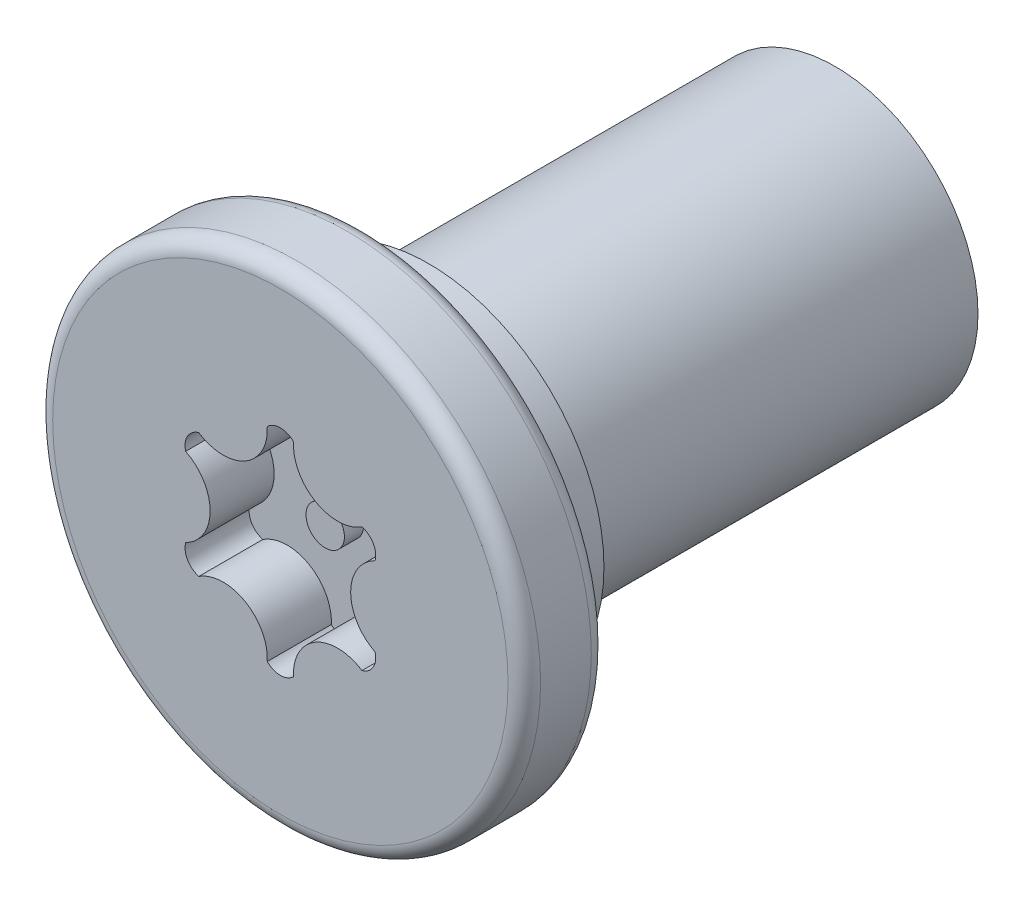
ISO-10303-21;
HEADER;
FILE_DESCRIPTION(('STEP AP214'),'2;1');
FILE_NAME('part.step','',(''),(''),'','','');
FILE_SCHEMA(('AUTOMOTIVE_DESIGN { 1 0 10303 214 1 1 1 1 }'));
ENDSEC;
DATA;
#1=APPLICATION_CONTEXT('core data for automotive mechanical design processes');
#2=APPLICATION_PROTOCOL_DEFINITION('international standard','automotive_design',2000,#1);
#3=PRODUCT_CONTEXT('',#1,'mechanical');
#4=PRODUCT('Part','Part','',(#3));
#5=PRODUCT_RELATED_PRODUCT_CATEGORY('part','',(#4));
#6=PRODUCT_DEFINITION_FORMATION('','',#4);
#7=PRODUCT_DEFINITION_CONTEXT('part definition',#1,'design');
#8=PRODUCT_DEFINITION('design','',#6,#7);
#9=PRODUCT_DEFINITION_SHAPE('','',#8);
#10=(LENGTH_UNIT() NAMED_UNIT(*) SI_UNIT(.MILLI.,.METRE.));
#11=(NAMED_UNIT(*) PLANE_ANGLE_UNIT() SI_UNIT($,.RADIAN.));
#12=(NAMED_UNIT(*) SI_UNIT($,.STERADIAN.) SOLID_ANGLE_UNIT());
#13=UNCERTAINTY_MEASURE_WITH_UNIT(LENGTH_MEASURE(1.E-05),#10,'distance_accuracy_value','');
#14=(GEOMETRIC_REPRESENTATION_CONTEXT(3) GLOBAL_UNCERTAINTY_ASSIGNED_CONTEXT((#13)) GLOBAL_UNIT_ASSIGNED_CONTEXT((#10,
#11,#12)) REPRESENTATION_CONTEXT('',''));
#15=CARTESIAN_POINT('',(0.,0.,0.));
#16=DIRECTION('',(0.,0.,1.));
#17=DIRECTION('',(1.,0.,0.));
#18=AXIS2_PLACEMENT_3D('',#15,#16,#17);
#19=CARTESIAN_POINT('',(0.,0.,0.));
#20=DIRECTION('',(0.,0.,1.));
#21=DIRECTION('',(1.,0.,0.));
#22=AXIS2_PLACEMENT_3D('',#19,#20,#21);
#23=PLANE('',#22);
#24=CARTESIAN_POINT('',(0.,0.,0.));
#25=DIRECTION('',(0.,0.,1.));
#26=DIRECTION('',(1.,0.,0.));
#27=AXIS2_PLACEMENT_3D('',#24,#25,#26);
#28=CIRCLE('',#27,3.55599999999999);
#29=CARTESIAN_POINT('',(3.55599999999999,0.,0.));
#30=VERTEX_POINT('',#29);
#31=EDGE_CURVE('E54',#30,#30,#28,.T.);
#32=ORIENTED_EDGE('',*,*,#31,.T.);
#33=EDGE_LOOP('',(#32));
#34=FACE_BOUND('',#33,.T.);
#35=CARTESIAN_POINT('',(0.893828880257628,1.54815703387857,0.));
#36=DIRECTION('',(0.,0.,1.));
#37=DIRECTION('',(1.,0.,0.));
#38=AXIS2_PLACEMENT_3D('',#35,#36,#37);
#39=CIRCLE('',#38,0.69);
#40=CARTESIAN_POINT('',(0.205060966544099,1.58937306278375,0.));
#41=VERTEX_POINT('',#40);
#42=CARTESIAN_POINT('',(1.27390696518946,0.972274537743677,0.));
#43=VERTEX_POINT('',#42);
#44=EDGE_CURVE('E181',#41,#43,#39,.T.);
#45=ORIENTED_EDGE('',*,*,#44,.T.);
#46=CARTESIAN_POINT('',(1.19884944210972,0.692156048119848,0.));
#47=DIRECTION('',(0.,0.,1.));
#48=DIRECTION('',(1.,0.,0.));
#49=AXIS2_PLACEMENT_3D('',#46,#47,#48);
#50=CIRCLE('',#49,0.29);
#51=CARTESIAN_POINT('',(1.47896793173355,0.617098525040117,0.));
#52=VERTEX_POINT('',#51);
#53=EDGE_CURVE('E61',#43,#52,#50,.F.);
#54=ORIENTED_EDGE('',*,*,#53,.T.);
#55=CARTESIAN_POINT('',(1.78765776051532,0.,0.));
#56=DIRECTION('',(0.,0.,1.));
#57=DIRECTION('',(1.,0.,0.));
#58=AXIS2_PLACEMENT_3D('',#55,#56,#57);
#59=CIRCLE('',#58,0.69);
#60=CARTESIAN_POINT('',(1.47896793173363,-0.617098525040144,0.));
#61=VERTEX_POINT('',#60);
#62=EDGE_CURVE('E111',#52,#61,#59,.T.);
#63=ORIENTED_EDGE('',*,*,#62,.T.);
#64=CARTESIAN_POINT('',(1.1988494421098,-0.692156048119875,0.));
#65=DIRECTION('',(0.,0.,1.));
#66=DIRECTION('',(1.,0.,0.));
#67=AXIS2_PLACEMENT_3D('',#64,#65,#66);
#68=CIRCLE('',#67,0.29);
#69=CARTESIAN_POINT('',(1.27390696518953,-0.972274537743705,0.));
#70=VERTEX_POINT('',#69);
#71=EDGE_CURVE('E216',#61,#70,#68,.F.);
#72=ORIENTED_EDGE('',*,*,#71,.T.);
#73=CARTESIAN_POINT('',(0.893828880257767,-1.54815703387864,0.));
#74=DIRECTION('',(0.,0.,1.));
#75=DIRECTION('',(1.,0.,0.));
#76=AXIS2_PLACEMENT_3D('',#73,#74,#75);
#77=CIRCLE('',#76,0.69);
#78=CARTESIAN_POINT('',(0.205060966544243,-1.5893730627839,0.));
#79=VERTEX_POINT('',#78);
#80=EDGE_CURVE('E160',#70,#79,#77,.T.);
#81=ORIENTED_EDGE('',*,*,#80,.T.);
#82=CARTESIAN_POINT('',(1.43067375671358E-13,-1.3843120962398,0.));
#83=DIRECTION('',(0.,0.,1.));
#84=DIRECTION('',(1.,0.,0.));
#85=AXIS2_PLACEMENT_3D('',#82,#83,#84);
#86=CIRCLE('',#85,0.29);
#87=CARTESIAN_POINT('',(-0.205060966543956,-1.5893730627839,0.));
#88=VERTEX_POINT('',#87);
#89=EDGE_CURVE('E210',#79,#88,#86,.F.);
#90=ORIENTED_EDGE('',*,*,#89,.T.);
#91=CARTESIAN_POINT('',(-0.893828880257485,-1.54815703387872,0.));
#92=DIRECTION('',(0.,0.,1.));
#93=DIRECTION('',(1.,0.,0.));
#94=AXIS2_PLACEMENT_3D('',#91,#92,#93);
#95=CIRCLE('',#94,0.69);
#96=CARTESIAN_POINT('',(-1.27390696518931,-0.97227453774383,0.));
#97=VERTEX_POINT('',#96);
#98=EDGE_CURVE('E206',#88,#97,#95,.T.);
#99=ORIENTED_EDGE('',*,*,#98,.T.);
#100=CARTESIAN_POINT('',(-1.19884944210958,-0.69215604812,0.));
#101=DIRECTION('',(0.,0.,1.));
#102=DIRECTION('',(1.,0.,0.));
#103=AXIS2_PLACEMENT_3D('',#100,#101,#102);
#104=CIRCLE('',#103,0.29);
#105=CARTESIAN_POINT('',(-1.47896793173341,-0.617098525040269,0.));
#106=VERTEX_POINT('',#105);
#107=EDGE_CURVE('E202',#97,#106,#104,.F.);
#108=ORIENTED_EDGE('',*,*,#107,.T.);
#109=CARTESIAN_POINT('',(-1.78765776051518,-1.56674837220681E-13,0.));
#110=DIRECTION('',(0.,0.,1.));
#111=DIRECTION('',(1.,0.,0.));
#112=AXIS2_PLACEMENT_3D('',#109,#110,#111);
#113=CIRCLE('',#112,0.69);
#114=CARTESIAN_POINT('',(-1.47896793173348,0.617098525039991,0.));
#115=VERTEX_POINT('',#114);
#116=EDGE_CURVE('E198',#106,#115,#113,.T.);
#117=ORIENTED_EDGE('',*,*,#116,.T.);
#118=CARTESIAN_POINT('',(-1.19884944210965,0.692156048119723,0.));
#119=DIRECTION('',(0.,0.,1.));
#120=DIRECTION('',(1.,0.,0.));
#121=AXIS2_PLACEMENT_3D('',#118,#119,#120);
#122=CIRCLE('',#121,0.29);
#123=CARTESIAN_POINT('',(-1.27390696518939,0.972274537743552,0.));
#124=VERTEX_POINT('',#123);
#125=EDGE_CURVE('E194',#115,#124,#122,.F.);
#126=ORIENTED_EDGE('',*,*,#125,.T.);
#127=CARTESIAN_POINT('',(-0.893828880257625,1.54815703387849,0.));
#128=DIRECTION('',(0.,0.,1.));
#129=DIRECTION('',(1.,0.,0.));
#130=AXIS2_PLACEMENT_3D('',#127,#128,#129);
#131=CIRCLE('',#130,0.690000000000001);
#132=CARTESIAN_POINT('',(-0.205060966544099,1.58937306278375,0.));
#133=VERTEX_POINT('',#132);
#134=EDGE_CURVE('E190',#124,#133,#131,.T.);
#135=ORIENTED_EDGE('',*,*,#134,.T.);
#136=CARTESIAN_POINT('',(0.,1.38431209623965,0.));
#137=DIRECTION('',(0.,0.,1.));
#138=DIRECTION('',(1.,0.,0.));
#139=AXIS2_PLACEMENT_3D('',#136,#137,#138);
#140=CIRCLE('',#139,0.29);
#141=EDGE_CURVE('E186',#133,#41,#140,.F.);
#142=ORIENTED_EDGE('',*,*,#141,.T.);
#143=EDGE_LOOP('',(#45,#54,#63,#72,#81,#90,#99,#108,#117,#126,#135,#142));
#144=FACE_BOUND('',#143,.T.);
#145=ADVANCED_FACE('F45',(#34,#144),#23,.T.);
#146=CARTESIAN_POINT('',(0.,0.,-1.3));
#147=DIRECTION('',(0.,0.,1.));
#148=DIRECTION('',(1.,0.,0.));
#149=AXIS2_PLACEMENT_3D('',#146,#147,#148);
#150=PLANE('',#149);
#151=CARTESIAN_POINT('',(0.,0.,-1.3));
#152=DIRECTION('',(0.,0.,1.));
#153=DIRECTION('',(1.,0.,0.));
#154=AXIS2_PLACEMENT_3D('',#151,#152,#153);
#155=CIRCLE('',#154,2.738000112);
#156=CARTESIAN_POINT('',(2.738000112,0.,-1.3));
#157=VERTEX_POINT('',#156);
#158=EDGE_CURVE('E11',#157,#157,#155,.F.);
#159=ORIENTED_EDGE('',*,*,#158,.F.);
#160=EDGE_LOOP('',(#159));
#161=FACE_BOUND('',#160,.T.);
#162=CARTESIAN_POINT('',(0.,0.,-1.3));
#163=DIRECTION('',(0.,0.,1.));
#164=DIRECTION('',(1.,0.,0.));
#165=AXIS2_PLACEMENT_3D('',#162,#163,#164);
#166=CIRCLE('',#165,3.55599999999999);
#167=CARTESIAN_POINT('',(3.55599999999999,0.,-1.3));
#168=VERTEX_POINT('',#167);
#169=EDGE_CURVE('E260',#168,#168,#166,.F.);
#170=ORIENTED_EDGE('',*,*,#169,.T.);
#171=EDGE_LOOP('',(#170));
#172=FACE_BOUND('',#171,.T.);
#173=ADVANCED_FACE('F283',(#161,#172),#150,.F.);
#174=CARTESIAN_POINT('',(0.,0.,-1.3));
#175=DIRECTION('',(0.,0.,1.));
#176=DIRECTION('',(1.,0.,0.));
#177=AXIS2_PLACEMENT_3D('',#174,#175,#176);
#178=CYLINDRICAL_SURFACE('',#177,3.80999999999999);
#179=CARTESIAN_POINT('',(0.,0.,-1.046));
#180=DIRECTION('',(0.,0.,1.));
#181=DIRECTION('',(1.,0.,0.));
#182=AXIS2_PLACEMENT_3D('',#179,#180,#181);
#183=CIRCLE('',#182,3.80999999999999);
#184=CARTESIAN_POINT('',(3.80999999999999,0.,-1.046));
#185=VERTEX_POINT('',#184);
#186=EDGE_CURVE('E256',#185,#185,#183,.T.);
#187=ORIENTED_EDGE('',*,*,#186,.T.);
#188=EDGE_LOOP('',(#187));
#189=FACE_BOUND('',#188,.T.);
#190=CARTESIAN_POINT('',(0.,0.,-0.254));
#191=DIRECTION('',(0.,0.,1.));
#192=DIRECTION('',(1.,0.,0.));
#193=AXIS2_PLACEMENT_3D('',#190,#191,#192);
#194=CIRCLE('',#193,3.80999999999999);
#195=CARTESIAN_POINT('',(3.80999999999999,0.,-0.254));
#196=VERTEX_POINT('',#195);
#197=EDGE_CURVE('E225',#196,#196,#194,.F.);
#198=ORIENTED_EDGE('',*,*,#197,.T.);
#199=EDGE_LOOP('',(#198));
#200=FACE_BOUND('',#199,.T.);
#201=ADVANCED_FACE('F289',(#189,#200),#178,.T.);
#202=CARTESIAN_POINT('',(1.19884944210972,0.692156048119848,-1.));
#203=DIRECTION('',(0.,0.,1.));
#204=DIRECTION('',(1.,0.,0.));
#205=AXIS2_PLACEMENT_3D('',#202,#203,#204);
#206=CYLINDRICAL_SURFACE('',#205,0.29);
#207=ORIENTED_EDGE('',*,*,#53,.F.);
#208=DIRECTION('',(0.,0.,1.));
#209=VECTOR('',#208,1.);
#210=CARTESIAN_POINT('',(1.27390696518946,0.972274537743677,-1.));
#211=LINE('',#210,#209);
#212=CARTESIAN_POINT('',(1.27390696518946,0.972274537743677,-1.));
#213=VERTEX_POINT('',#212);
#214=EDGE_CURVE('E178',#213,#43,#211,.T.);
#215=ORIENTED_EDGE('',*,*,#214,.F.);
#216=CARTESIAN_POINT('',(1.19884944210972,0.692156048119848,-1.));
#217=DIRECTION('',(0.,0.,1.));
#218=DIRECTION('',(1.,0.,0.));
#219=AXIS2_PLACEMENT_3D('',#216,#217,#218);
#220=CIRCLE('',#219,0.29);
#221=CARTESIAN_POINT('',(1.47896793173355,0.617098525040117,-1.));
#222=VERTEX_POINT('',#221);
#223=EDGE_CURVE('E221',#213,#222,#220,.F.);
#224=ORIENTED_EDGE('',*,*,#223,.T.);
#225=DIRECTION('',(0.,0.,1.));
#226=VECTOR('',#225,1.);
#227=CARTESIAN_POINT('',(1.47896793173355,0.617098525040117,-1.));
#228=LINE('',#227,#226);
#229=EDGE_CURVE('E222',#222,#52,#228,.T.);
#230=ORIENTED_EDGE('',*,*,#229,.T.);
#231=EDGE_LOOP('',(#207,#215,#224,#230));
#232=FACE_BOUND('',#231,.T.);
#233=ADVANCED_FACE('F294',(#232),#206,.F.);
#234=CARTESIAN_POINT('',(1.78765776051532,0.,-1.));
#235=DIRECTION('',(0.,0.,1.));
#236=DIRECTION('',(1.,0.,0.));
#237=AXIS2_PLACEMENT_3D('',#234,#235,#236);
#238=CYLINDRICAL_SURFACE('',#237,0.69);
#239=ORIENTED_EDGE('',*,*,#62,.F.);
#240=ORIENTED_EDGE('',*,*,#229,.F.);
#241=CARTESIAN_POINT('',(1.78765776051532,0.,-1.));
#242=DIRECTION('',(0.,0.,1.));
#243=DIRECTION('',(1.,0.,0.));
#244=AXIS2_PLACEMENT_3D('',#241,#242,#243);
#245=CIRCLE('',#244,0.69);
#246=CARTESIAN_POINT('',(1.47896793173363,-0.617098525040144,-1.));
#247=VERTEX_POINT('',#246);
#248=EDGE_CURVE('E70',#222,#247,#245,.T.);
#249=ORIENTED_EDGE('',*,*,#248,.T.);
#250=DIRECTION('',(0.,0.,1.));
#251=VECTOR('',#250,1.);
#252=CARTESIAN_POINT('',(1.47896793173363,-0.617098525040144,-1.));
#253=LINE('',#252,#251);
#254=EDGE_CURVE('E151',#247,#61,#253,.T.);
#255=ORIENTED_EDGE('',*,*,#254,.T.);
#256=EDGE_LOOP('',(#239,#240,#249,#255));
#257=FACE_BOUND('',#256,.T.);
#258=ADVANCED_FACE('F301',(#257),#238,.T.);
#259=CARTESIAN_POINT('',(1.1988494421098,-0.692156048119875,-1.));
#260=DIRECTION('',(0.,0.,1.));
#261=DIRECTION('',(1.,0.,0.));
#262=AXIS2_PLACEMENT_3D('',#259,#260,#261);
#263=CYLINDRICAL_SURFACE('',#262,0.29);
#264=ORIENTED_EDGE('',*,*,#71,.F.);
#265=ORIENTED_EDGE('',*,*,#254,.F.);
#266=CARTESIAN_POINT('',(1.1988494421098,-0.692156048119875,-1.));
#267=DIRECTION('',(0.,0.,1.));
#268=DIRECTION('',(1.,0.,0.));
#269=AXIS2_PLACEMENT_3D('',#266,#267,#268);
#270=CIRCLE('',#269,0.29);
#271=CARTESIAN_POINT('',(1.27390696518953,-0.972274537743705,-1.));
#272=VERTEX_POINT('',#271);
#273=EDGE_CURVE('E145',#247,#272,#270,.F.);
#274=ORIENTED_EDGE('',*,*,#273,.T.);
#275=DIRECTION('',(0.,0.,1.));
#276=VECTOR('',#275,1.);
#277=CARTESIAN_POINT('',(1.27390696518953,-0.972274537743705,-1.));
#278=LINE('',#277,#276);
#279=EDGE_CURVE('E149',#272,#70,#278,.T.);
#280=ORIENTED_EDGE('',*,*,#279,.T.);
#281=EDGE_LOOP('',(#264,#265,#274,#280));
#282=FACE_BOUND('',#281,.T.);
#283=ADVANCED_FACE('F148',(#282),#263,.F.);
#284=CARTESIAN_POINT('',(0.893828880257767,-1.54815703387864,-1.));
#285=DIRECTION('',(0.,0.,1.));
#286=DIRECTION('',(1.,0.,0.));
#287=AXIS2_PLACEMENT_3D('',#284,#285,#286);
#288=CYLINDRICAL_SURFACE('',#287,0.69);
#289=ORIENTED_EDGE('',*,*,#80,.F.);
#290=ORIENTED_EDGE('',*,*,#279,.F.);
#291=CARTESIAN_POINT('',(0.893828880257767,-1.54815703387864,-1.));
#292=DIRECTION('',(0.,0.,1.));
#293=DIRECTION('',(1.,0.,0.));
#294=AXIS2_PLACEMENT_3D('',#291,#292,#293);
#295=CIRCLE('',#294,0.69);
#296=CARTESIAN_POINT('',(0.205060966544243,-1.5893730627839,-1.));
#297=VERTEX_POINT('',#296);
#298=EDGE_CURVE('E154',#272,#297,#295,.T.);
#299=ORIENTED_EDGE('',*,*,#298,.T.);
#300=DIRECTION('',(0.,0.,1.));
#301=VECTOR('',#300,1.);
#302=CARTESIAN_POINT('',(0.205060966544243,-1.5893730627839,-1.));
#303=LINE('',#302,#301);
#304=EDGE_CURVE('E163',#297,#79,#303,.T.);
#305=ORIENTED_EDGE('',*,*,#304,.T.);
#306=EDGE_LOOP('',(#289,#290,#299,#305));
#307=FACE_BOUND('',#306,.T.);
#308=ADVANCED_FACE('F157',(#307),#288,.T.);
#309=CARTESIAN_POINT('',(1.43067375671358E-13,-1.3843120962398,-1.));
#310=DIRECTION('',(0.,0.,1.));
#311=DIRECTION('',(1.,0.,0.));
#312=AXIS2_PLACEMENT_3D('',#309,#310,#311);
#313=CYLINDRICAL_SURFACE('',#312,0.29);
#314=ORIENTED_EDGE('',*,*,#89,.F.);
#315=ORIENTED_EDGE('',*,*,#304,.F.);
#316=CARTESIAN_POINT('',(1.43067375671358E-13,-1.3843120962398,-1.));
#317=DIRECTION('',(0.,0.,1.));
#318=DIRECTION('',(1.,0.,0.));
#319=AXIS2_PLACEMENT_3D('',#316,#317,#318);
#320=CIRCLE('',#319,0.29);
#321=CARTESIAN_POINT('',(-0.205060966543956,-1.5893730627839,-1.));
#322=VERTEX_POINT('',#321);
#323=EDGE_CURVE('E168',#297,#322,#320,.F.);
#324=ORIENTED_EDGE('',*,*,#323,.T.);
#325=DIRECTION('',(0.,0.,1.));
#326=VECTOR('',#325,1.);
#327=CARTESIAN_POINT('',(-0.205060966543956,-1.5893730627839,-1.));
#328=LINE('',#327,#326);
#329=EDGE_CURVE('E230',#322,#88,#328,.T.);
#330=ORIENTED_EDGE('',*,*,#329,.T.);
#331=EDGE_LOOP('',(#314,#315,#324,#330));
#332=FACE_BOUND('',#331,.T.);
#333=ADVANCED_FACE('F318',(#332),#313,.F.);
#334=CARTESIAN_POINT('',(-0.893828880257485,-1.54815703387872,-1.));
#335=DIRECTION('',(0.,0.,1.));
#336=DIRECTION('',(1.,0.,0.));
#337=AXIS2_PLACEMENT_3D('',#334,#335,#336);
#338=CYLINDRICAL_SURFACE('',#337,0.69);
#339=ORIENTED_EDGE('',*,*,#98,.F.);
#340=ORIENTED_EDGE('',*,*,#329,.F.);
#341=CARTESIAN_POINT('',(-0.893828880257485,-1.54815703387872,-1.));
#342=DIRECTION('',(0.,0.,1.));
#343=DIRECTION('',(1.,0.,0.));
#344=AXIS2_PLACEMENT_3D('',#341,#342,#343);
#345=CIRCLE('',#344,0.69);
#346=CARTESIAN_POINT('',(-1.27390696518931,-0.97227453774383,-1.));
#347=VERTEX_POINT('',#346);
#348=EDGE_CURVE('E172',#322,#347,#345,.T.);
#349=ORIENTED_EDGE('',*,*,#348,.T.);
#350=DIRECTION('',(0.,0.,1.));
#351=VECTOR('',#350,1.);
#352=CARTESIAN_POINT('',(-1.27390696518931,-0.97227453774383,-1.));
#353=LINE('',#352,#351);
#354=EDGE_CURVE('E233',#347,#97,#353,.T.);
#355=ORIENTED_EDGE('',*,*,#354,.T.);
#356=EDGE_LOOP('',(#339,#340,#349,#355));
#357=FACE_BOUND('',#356,.T.);
#358=ADVANCED_FACE('F321',(#357),#338,.T.);
#359=CARTESIAN_POINT('',(-1.19884944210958,-0.69215604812,-1.));
#360=DIRECTION('',(0.,0.,1.));
#361=DIRECTION('',(1.,0.,0.));
#362=AXIS2_PLACEMENT_3D('',#359,#360,#361);
#363=CYLINDRICAL_SURFACE('',#362,0.29);
#364=ORIENTED_EDGE('',*,*,#107,.F.);
#365=ORIENTED_EDGE('',*,*,#354,.F.);
#366=CARTESIAN_POINT('',(-1.19884944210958,-0.69215604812,-1.));
#367=DIRECTION('',(0.,0.,1.));
#368=DIRECTION('',(1.,0.,0.));
#369=AXIS2_PLACEMENT_3D('',#366,#367,#368);
#370=CIRCLE('',#369,0.29);
#371=CARTESIAN_POINT('',(-1.47896793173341,-0.617098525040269,-1.));
#372=VERTEX_POINT('',#371);
#373=EDGE_CURVE('E374',#347,#372,#370,.F.);
#374=ORIENTED_EDGE('',*,*,#373,.T.);
#375=DIRECTION('',(0.,0.,1.));
#376=VECTOR('',#375,1.);
#377=CARTESIAN_POINT('',(-1.47896793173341,-0.617098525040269,-1.));
#378=LINE('',#377,#376);
#379=EDGE_CURVE('E236',#372,#106,#378,.T.);
#380=ORIENTED_EDGE('',*,*,#379,.T.);
#381=EDGE_LOOP('',(#364,#365,#374,#380));
#382=FACE_BOUND('',#381,.T.);
#383=ADVANCED_FACE('F325',(#382),#363,.F.);
#384=CARTESIAN_POINT('',(-1.78765776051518,-1.56674837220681E-13,-1.));
#385=DIRECTION('',(0.,0.,1.));
#386=DIRECTION('',(1.,0.,0.));
#387=AXIS2_PLACEMENT_3D('',#384,#385,#386);
#388=CYLINDRICAL_SURFACE('',#387,0.69);
#389=ORIENTED_EDGE('',*,*,#116,.F.);
#390=ORIENTED_EDGE('',*,*,#379,.F.);
#391=CARTESIAN_POINT('',(-1.78765776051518,-1.56674837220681E-13,-1.));
#392=DIRECTION('',(0.,0.,1.));
#393=DIRECTION('',(1.,0.,0.));
#394=AXIS2_PLACEMENT_3D('',#391,#392,#393);
#395=CIRCLE('',#394,0.69);
#396=CARTESIAN_POINT('',(-1.47896793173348,0.617098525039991,-1.));
#397=VERTEX_POINT('',#396);
#398=EDGE_CURVE('E371',#372,#397,#395,.T.);
#399=ORIENTED_EDGE('',*,*,#398,.T.);
#400=DIRECTION('',(0.,0.,1.));
#401=VECTOR('',#400,1.);
#402=CARTESIAN_POINT('',(-1.47896793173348,0.617098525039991,-1.));
#403=LINE('',#402,#401);
#404=EDGE_CURVE('E239',#397,#115,#403,.T.);
#405=ORIENTED_EDGE('',*,*,#404,.T.);
#406=EDGE_LOOP('',(#389,#390,#399,#405));
#407=FACE_BOUND('',#406,.T.);
#408=ADVANCED_FACE('F329',(#407),#388,.T.);
#409=CARTESIAN_POINT('',(-1.19884944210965,0.692156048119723,-1.));
#410=DIRECTION('',(0.,0.,1.));
#411=DIRECTION('',(1.,0.,0.));
#412=AXIS2_PLACEMENT_3D('',#409,#410,#411);
#413=CYLINDRICAL_SURFACE('',#412,0.29);
#414=ORIENTED_EDGE('',*,*,#125,.F.);
#415=ORIENTED_EDGE('',*,*,#404,.F.);
#416=CARTESIAN_POINT('',(-1.19884944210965,0.692156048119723,-1.));
#417=DIRECTION('',(0.,0.,1.));
#418=DIRECTION('',(1.,0.,0.));
#419=AXIS2_PLACEMENT_3D('',#416,#417,#418);
#420=CIRCLE('',#419,0.29);
#421=CARTESIAN_POINT('',(-1.27390696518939,0.972274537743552,-1.));
#422=VERTEX_POINT('',#421);
#423=EDGE_CURVE('E364',#397,#422,#420,.F.);
#424=ORIENTED_EDGE('',*,*,#423,.T.);
#425=DIRECTION('',(0.,0.,1.));
#426=VECTOR('',#425,1.);
#427=CARTESIAN_POINT('',(-1.27390696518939,0.972274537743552,-1.));
#428=LINE('',#427,#426);
#429=EDGE_CURVE('E242',#422,#124,#428,.T.);
#430=ORIENTED_EDGE('',*,*,#429,.T.);
#431=EDGE_LOOP('',(#414,#415,#424,#430));
#432=FACE_BOUND('',#431,.T.);
#433=ADVANCED_FACE('F333',(#432),#413,.F.);
#434=CARTESIAN_POINT('',(-0.893828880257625,1.54815703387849,-1.));
#435=DIRECTION('',(0.,0.,1.));
#436=DIRECTION('',(1.,0.,0.));
#437=AXIS2_PLACEMENT_3D('',#434,#435,#436);
#438=CYLINDRICAL_SURFACE('',#437,0.690000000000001);
#439=ORIENTED_EDGE('',*,*,#134,.F.);
#440=ORIENTED_EDGE('',*,*,#429,.F.);
#441=CARTESIAN_POINT('',(-0.893828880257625,1.54815703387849,-1.));
#442=DIRECTION('',(0.,0.,1.));
#443=DIRECTION('',(1.,0.,0.));
#444=AXIS2_PLACEMENT_3D('',#441,#442,#443);
#445=CIRCLE('',#444,0.690000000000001);
#446=CARTESIAN_POINT('',(-0.205060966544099,1.58937306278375,-1.));
#447=VERTEX_POINT('',#446);
#448=EDGE_CURVE('E360',#422,#447,#445,.T.);
#449=ORIENTED_EDGE('',*,*,#448,.T.);
#450=DIRECTION('',(0.,0.,1.));
#451=VECTOR('',#450,1.);
#452=CARTESIAN_POINT('',(-0.205060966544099,1.58937306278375,-1.));
#453=LINE('',#452,#451);
#454=EDGE_CURVE('E245',#447,#133,#453,.T.);
#455=ORIENTED_EDGE('',*,*,#454,.T.);
#456=EDGE_LOOP('',(#439,#440,#449,#455));
#457=FACE_BOUND('',#456,.T.);
#458=ADVANCED_FACE('F337',(#457),#438,.T.);
#459=CARTESIAN_POINT('',(0.,1.38431209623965,-1.));
#460=DIRECTION('',(0.,0.,1.));
#461=DIRECTION('',(1.,0.,0.));
#462=AXIS2_PLACEMENT_3D('',#459,#460,#461);
#463=CYLINDRICAL_SURFACE('',#462,0.29);
#464=ORIENTED_EDGE('',*,*,#141,.F.);
#465=ORIENTED_EDGE('',*,*,#454,.F.);
#466=CARTESIAN_POINT('',(0.,1.38431209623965,-1.));
#467=DIRECTION('',(0.,0.,1.));
#468=DIRECTION('',(1.,0.,0.));
#469=AXIS2_PLACEMENT_3D('',#466,#467,#468);
#470=CIRCLE('',#469,0.29);
#471=CARTESIAN_POINT('',(0.205060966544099,1.58937306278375,-1.));
#472=VERTEX_POINT('',#471);
#473=EDGE_CURVE('E357',#447,#472,#470,.F.);
#474=ORIENTED_EDGE('',*,*,#473,.T.);
#475=DIRECTION('',(0.,0.,1.));
#476=VECTOR('',#475,1.);
#477=CARTESIAN_POINT('',(0.205060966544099,1.58937306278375,-1.));
#478=LINE('',#477,#476);
#479=EDGE_CURVE('E248',#472,#41,#478,.T.);
#480=ORIENTED_EDGE('',*,*,#479,.T.);
#481=EDGE_LOOP('',(#464,#465,#474,#480));
#482=FACE_BOUND('',#481,.T.);
#483=ADVANCED_FACE('F341',(#482),#463,.F.);
#484=CARTESIAN_POINT('',(0.893828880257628,1.54815703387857,-1.));
#485=DIRECTION('',(0.,0.,1.));
#486=DIRECTION('',(1.,0.,0.));
#487=AXIS2_PLACEMENT_3D('',#484,#485,#486);
#488=CYLINDRICAL_SURFACE('',#487,0.69);
#489=ORIENTED_EDGE('',*,*,#44,.F.);
#490=ORIENTED_EDGE('',*,*,#479,.F.);
#491=CARTESIAN_POINT('',(0.893828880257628,1.54815703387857,-1.));
#492=DIRECTION('',(0.,0.,1.));
#493=DIRECTION('',(1.,0.,0.));
#494=AXIS2_PLACEMENT_3D('',#491,#492,#493);
#495=CIRCLE('',#494,0.69);
#496=EDGE_CURVE('E118',#472,#213,#495,.T.);
#497=ORIENTED_EDGE('',*,*,#496,.T.);
#498=ORIENTED_EDGE('',*,*,#214,.T.);
#499=EDGE_LOOP('',(#489,#490,#497,#498));
#500=FACE_BOUND('',#499,.T.);
#501=ADVANCED_FACE('F344',(#500),#488,.T.);
#502=CARTESIAN_POINT('',(0.,0.,-1.));
#503=DIRECTION('',(0.,0.,1.));
#504=DIRECTION('',(1.,0.,0.));
#505=AXIS2_PLACEMENT_3D('',#502,#503,#504);
#506=PLANE('',#505);
#507=CARTESIAN_POINT('',(0.,0.,-1.));
#508=DIRECTION('',(0.,0.,1.));
#509=DIRECTION('',(1.,0.,0.));
#510=AXIS2_PLACEMENT_3D('',#507,#508,#509);
#511=CIRCLE('',#510,0.3);
#512=CARTESIAN_POINT('',(0.3,0.,-1.));
#513=VERTEX_POINT('',#512);
#514=EDGE_CURVE('E396',#513,#513,#511,.T.);
#515=ORIENTED_EDGE('',*,*,#514,.F.);
#516=EDGE_LOOP('',(#515));
#517=FACE_BOUND('',#516,.T.);
#518=ORIENTED_EDGE('',*,*,#223,.F.);
#519=ORIENTED_EDGE('',*,*,#496,.F.);
#520=ORIENTED_EDGE('',*,*,#473,.F.);
#521=ORIENTED_EDGE('',*,*,#448,.F.);
#522=ORIENTED_EDGE('',*,*,#423,.F.);
#523=ORIENTED_EDGE('',*,*,#398,.F.);
#524=ORIENTED_EDGE('',*,*,#373,.F.);
#525=ORIENTED_EDGE('',*,*,#348,.F.);
#526=ORIENTED_EDGE('',*,*,#323,.F.);
#527=ORIENTED_EDGE('',*,*,#298,.F.);
#528=ORIENTED_EDGE('',*,*,#273,.F.);
#529=ORIENTED_EDGE('',*,*,#248,.F.);
#530=EDGE_LOOP('',(#518,#519,#520,#521,#522,#523,#524,#525,#526,#527,#528,#529));
#531=FACE_BOUND('',#530,.T.);
#532=ADVANCED_FACE('F166',(#517,#531),#506,.T.);
#533=CARTESIAN_POINT('',(0.,0.,-1.046));
#534=DIRECTION('',(0.,0.,1.));
#535=DIRECTION('',(1.,0.,0.));
#536=AXIS2_PLACEMENT_3D('',#533,#534,#535);
#537=TOROIDAL_SURFACE('',#536,3.55599999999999,0.254);
#538=ORIENTED_EDGE('',*,*,#169,.F.);
#539=EDGE_LOOP('',(#538));
#540=FACE_BOUND('',#539,.T.);
#541=ORIENTED_EDGE('',*,*,#186,.F.);
#542=EDGE_LOOP('',(#541));
#543=FACE_BOUND('',#542,.T.);
#544=ADVANCED_FACE('F271',(#540,#543),#537,.T.);
#545=CARTESIAN_POINT('',(0.,0.,-0.254));
#546=DIRECTION('',(0.,0.,1.));
#547=DIRECTION('',(1.,0.,0.));
#548=AXIS2_PLACEMENT_3D('',#545,#546,#547);
#549=TOROIDAL_SURFACE('',#548,3.55599999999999,0.254);
#550=ORIENTED_EDGE('',*,*,#197,.F.);
#551=EDGE_LOOP('',(#550));
#552=FACE_BOUND('',#551,.T.);
#553=ORIENTED_EDGE('',*,*,#31,.F.);
#554=EDGE_LOOP('',(#553));
#555=FACE_BOUND('',#554,.T.);
#556=ADVANCED_FACE('F47',(#552,#555),#549,.T.);
#557=CARTESIAN_POINT('',(0.,0.,-2.316));
#558=DIRECTION('',(0.,0.,-1.));
#559=DIRECTION('',(-1.,0.,0.));
#560=AXIS2_PLACEMENT_3D('',#557,#558,#559);
#561=PLANE('',#560);
#562=CARTESIAN_POINT('',(0.,0.,-2.316));
#563=DIRECTION('',(0.,0.,-1.));
#564=DIRECTION('',(-1.,0.,0.));
#565=AXIS2_PLACEMENT_3D('',#562,#563,#564);
#566=CIRCLE('',#565,2.738000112);
#567=CARTESIAN_POINT('',(-2.738000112,0.,-2.316));
#568=VERTEX_POINT('',#567);
#569=EDGE_CURVE('E182',#568,#568,#566,.T.);
#570=ORIENTED_EDGE('',*,*,#569,.T.);
#571=EDGE_LOOP('',(#570));
#572=FACE_BOUND('',#571,.T.);
#573=CARTESIAN_POINT('',(0.,0.,-2.316));
#574=DIRECTION('',(0.,0.,-1.));
#575=DIRECTION('',(-1.,0.,0.));
#576=AXIS2_PLACEMENT_3D('',#573,#574,#575);
#577=CIRCLE('',#576,2.230000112);
#578=CARTESIAN_POINT('',(-2.230000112,0.,-2.316));
#579=VERTEX_POINT('',#578);
#580=EDGE_CURVE('E400',#579,#579,#577,.T.);
#581=ORIENTED_EDGE('',*,*,#580,.F.);
#582=EDGE_LOOP('',(#581));
#583=FACE_BOUND('',#582,.T.);
#584=ADVANCED_FACE('F270',(#572,#583),#561,.T.);
#585=CARTESIAN_POINT('',(0.,0.,-2.316));
#586=DIRECTION('',(0.,0.,1.));
#587=DIRECTION('',(1.,0.,0.));
#588=AXIS2_PLACEMENT_3D('',#585,#586,#587);
#589=CYLINDRICAL_SURFACE('',#588,2.738000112);
#590=ORIENTED_EDGE('',*,*,#569,.F.);
#591=EDGE_LOOP('',(#590));
#592=FACE_BOUND('',#591,.T.);
#593=ORIENTED_EDGE('',*,*,#158,.T.);
#594=EDGE_LOOP('',(#593));
#595=FACE_BOUND('',#594,.T.);
#596=ADVANCED_FACE('F277',(#592,#595),#589,.T.);
#597=CARTESIAN_POINT('',(0.,0.,-0.7));
#598=DIRECTION('',(0.,0.,-1.));
#599=DIRECTION('',(-1.,0.,0.));
#600=AXIS2_PLACEMENT_3D('',#597,#598,#599);
#601=CYLINDRICAL_SURFACE('',#600,0.3);
#602=CARTESIAN_POINT('',(0.,0.,-0.7));
#603=DIRECTION('',(0.,0.,1.));
#604=DIRECTION('',(1.,0.,0.));
#605=AXIS2_PLACEMENT_3D('',#602,#603,#604);
#606=CIRCLE('',#605,0.3);
#607=CARTESIAN_POINT('',(0.3,0.,-0.7));
#608=VERTEX_POINT('',#607);
#609=EDGE_CURVE('E395',#608,#608,#606,.T.);
#610=ORIENTED_EDGE('',*,*,#609,.F.);
#611=EDGE_LOOP('',(#610));
#612=FACE_BOUND('',#611,.T.);
#613=ORIENTED_EDGE('',*,*,#514,.T.);
#614=EDGE_LOOP('',(#613));
#615=FACE_BOUND('',#614,.T.);
#616=ADVANCED_FACE('F424',(#612,#615),#601,.T.);
#617=CARTESIAN_POINT('',(0.,0.,-0.7));
#618=DIRECTION('',(0.,0.,1.));
#619=DIRECTION('',(1.,0.,0.));
#620=AXIS2_PLACEMENT_3D('',#617,#618,#619);
#621=PLANE('',#620);
#622=ORIENTED_EDGE('',*,*,#609,.T.);
#623=EDGE_LOOP('',(#622));
#624=FACE_BOUND('',#623,.T.);
#625=ADVANCED_FACE('F416',(#624),#621,.T.);
#626=CARTESIAN_POINT('',(0.,0.,-8.666));
#627=DIRECTION('',(0.,0.,1.));
#628=DIRECTION('',(1.,0.,0.));
#629=AXIS2_PLACEMENT_3D('',#626,#627,#628);
#630=CYLINDRICAL_SURFACE('',#629,2.230000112);
#631=ORIENTED_EDGE('',*,*,#580,.T.);
#632=EDGE_LOOP('',(#631));
#633=FACE_BOUND('',#632,.T.);
#634=CARTESIAN_POINT('',(0.,0.,-8.666));
#635=DIRECTION('',(0.,0.,-1.));
#636=DIRECTION('',(-1.,0.,0.));
#637=AXIS2_PLACEMENT_3D('',#634,#635,#636);
#638=CIRCLE('',#637,2.230000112);
#639=CARTESIAN_POINT('',(-2.230000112,0.,-8.666));
#640=VERTEX_POINT('',#639);
#641=EDGE_CURVE('E407',#640,#640,#638,.T.);
#642=ORIENTED_EDGE('',*,*,#641,.F.);
#643=EDGE_LOOP('',(#642));
#644=FACE_BOUND('',#643,.T.);
#645=ADVANCED_FACE('F414',(#633,#644),#630,.T.);
#646=CARTESIAN_POINT('',(0.,0.,-8.666));
#647=DIRECTION('',(0.,0.,-1.));
#648=DIRECTION('',(-1.,0.,0.));
#649=AXIS2_PLACEMENT_3D('',#646,#647,#648);
#650=PLANE('',#649);
#651=ORIENTED_EDGE('',*,*,#641,.T.);
#652=EDGE_LOOP('',(#651));
#653=FACE_BOUND('',#652,.T.);
#654=ADVANCED_FACE('F412',(#653),#650,.T.);
#655=CLOSED_SHELL('',(#145,#173,#201,#233,#258,#283,#308,#333,#358,#383,#408,#433,#458,#483,
#501,#532,#544,#556,#584,#596,#616,#625,#645,#654));
#656=MANIFOLD_SOLID_BREP('B2',#655);
#657=ADVANCED_BREP_SHAPE_REPRESENTATION('',(#18,#656),#14);
#658=SHAPE_DEFINITION_REPRESENTATION(#9,#657);
ENDSEC;
END-ISO-10303-21;
